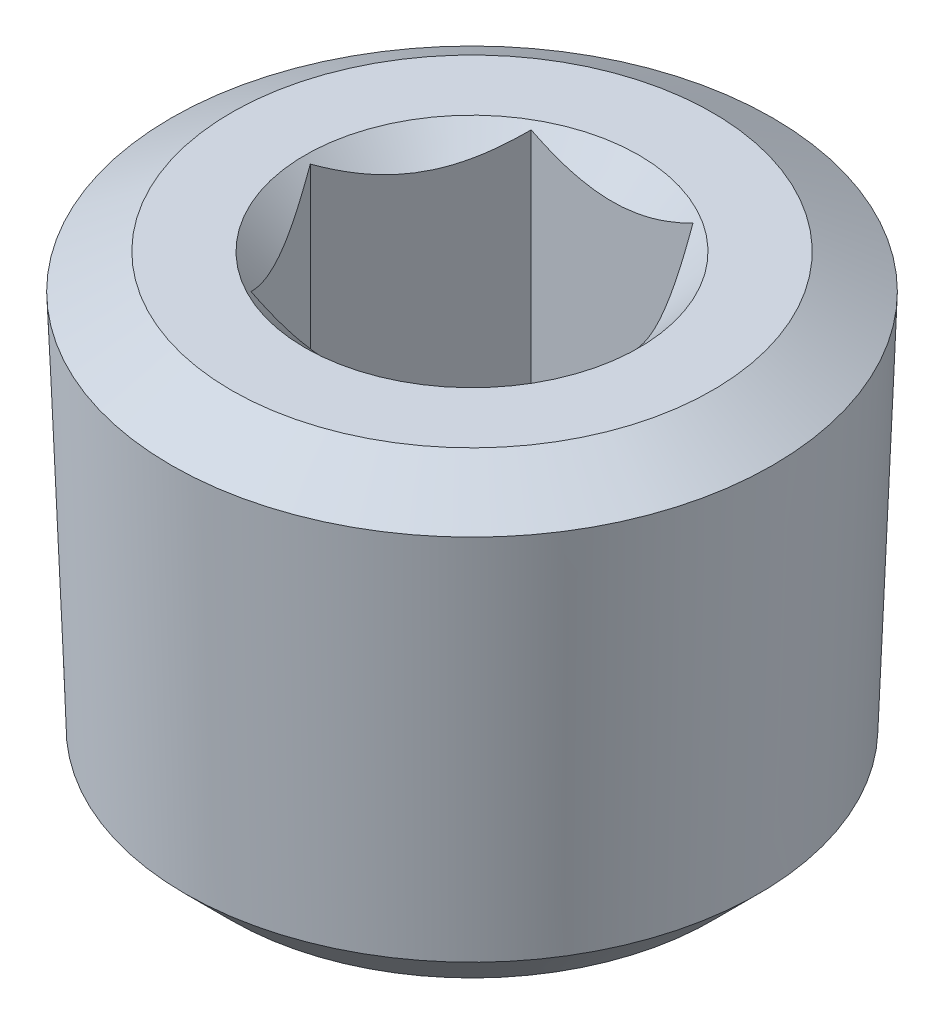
ISO-10303-21;
HEADER;
FILE_DESCRIPTION(('STEP AP214'),'2;1');
FILE_NAME('part.step','',(''),(''),'','','');
FILE_SCHEMA(('AUTOMOTIVE_DESIGN { 1 0 10303 214 1 1 1 1 }'));
ENDSEC;
DATA;
#1=APPLICATION_CONTEXT('core data for automotive mechanical design processes');
#2=APPLICATION_PROTOCOL_DEFINITION('international standard','automotive_design',2000,#1);
#3=PRODUCT_CONTEXT('',#1,'mechanical');
#4=PRODUCT('Part','Part','',(#3));
#5=PRODUCT_RELATED_PRODUCT_CATEGORY('part','',(#4));
#6=PRODUCT_DEFINITION_FORMATION('','',#4);
#7=PRODUCT_DEFINITION_CONTEXT('part definition',#1,'design');
#8=PRODUCT_DEFINITION('design','',#6,#7);
#9=PRODUCT_DEFINITION_SHAPE('','',#8);
#10=(LENGTH_UNIT() NAMED_UNIT(*) SI_UNIT(.MILLI.,.METRE.));
#11=(NAMED_UNIT(*) PLANE_ANGLE_UNIT() SI_UNIT($,.RADIAN.));
#12=(NAMED_UNIT(*) SI_UNIT($,.STERADIAN.) SOLID_ANGLE_UNIT());
#13=UNCERTAINTY_MEASURE_WITH_UNIT(LENGTH_MEASURE(1.E-05),#10,'distance_accuracy_value','');
#14=(GEOMETRIC_REPRESENTATION_CONTEXT(3) GLOBAL_UNCERTAINTY_ASSIGNED_CONTEXT((#13)) GLOBAL_UNIT_ASSIGNED_CONTEXT((#10,
#11,#12)) REPRESENTATION_CONTEXT('',''));
#15=CARTESIAN_POINT('',(0.,0.,0.));
#16=DIRECTION('',(0.,0.,1.));
#17=DIRECTION('',(1.,0.,0.));
#18=AXIS2_PLACEMENT_3D('',#15,#16,#17);
#19=CARTESIAN_POINT('',(0.,0.,0.));
#20=DIRECTION('',(0.,1.,0.));
#21=DIRECTION('',(0.,0.,1.));
#22=AXIS2_PLACEMENT_3D('',#19,#20,#21);
#23=PLANE('',#22);
#24=CARTESIAN_POINT('',(0.,0.,0.));
#25=DIRECTION('',(0.,1.,0.));
#26=DIRECTION('',(0.,0.,1.));
#27=AXIS2_PLACEMENT_3D('',#24,#25,#26);
#28=CIRCLE('',#27,4.7371);
#29=CARTESIAN_POINT('',(0.,0.,4.7371));
#30=VERTEX_POINT('',#29);
#31=EDGE_CURVE('E245',#30,#30,#28,.T.);
#32=ORIENTED_EDGE('',*,*,#31,.F.);
#33=EDGE_LOOP('',(#32));
#34=FACE_BOUND('',#33,.T.);
#35=CARTESIAN_POINT('',(0.,0.,0.));
#36=DIRECTION('',(0.,1.,0.));
#37=DIRECTION('',(0.,0.,1.));
#38=AXIS2_PLACEMENT_3D('',#35,#36,#37);
#39=CIRCLE('',#38,6.82743694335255);
#40=CARTESIAN_POINT('',(0.,0.,6.82743694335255));
#41=VERTEX_POINT('',#40);
#42=EDGE_CURVE('E12',#41,#41,#39,.T.);
#43=ORIENTED_EDGE('',*,*,#42,.T.);
#44=EDGE_LOOP('',(#43));
#45=FACE_BOUND('',#44,.T.);
#46=ADVANCED_FACE('F34',(#34,#45),#23,.T.);
#47=CARTESIAN_POINT('',(0.,0.,0.));
#48=DIRECTION('',(0.,-1.,0.));
#49=DIRECTION('',(0.,0.,-1.));
#50=AXIS2_PLACEMENT_3D('',#47,#48,#49);
#51=CONICAL_SURFACE('',#50,6.82743694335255,1.0471975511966);
#52=CARTESIAN_POINT('',(0.,-0.986742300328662,0.));
#53=DIRECTION('',(0.,1.,0.));
#54=DIRECTION('',(0.,0.,1.));
#55=AXIS2_PLACEMENT_3D('',#52,#53,#54);
#56=CIRCLE('',#55,8.53652474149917);
#57=CARTESIAN_POINT('',(0.,-0.986742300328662,8.53652474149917));
#58=VERTEX_POINT('',#57);
#59=EDGE_CURVE('E41',#58,#58,#56,.T.);
#60=ORIENTED_EDGE('',*,*,#59,.T.);
#61=EDGE_LOOP('',(#60));
#62=FACE_BOUND('',#61,.T.);
#63=ORIENTED_EDGE('',*,*,#42,.F.);
#64=EDGE_LOOP('',(#63));
#65=FACE_BOUND('',#64,.T.);
#66=ADVANCED_FACE('F235',(#62,#65),#51,.T.);
#67=CARTESIAN_POINT('',(0.,-0.986742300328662,0.));
#68=DIRECTION('',(0.,1.,0.));
#69=DIRECTION('',(0.,0.,1.));
#70=AXIS2_PLACEMENT_3D('',#67,#68,#69);
#71=CONICAL_SURFACE('',#70,8.53652474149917,0.0364424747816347);
#72=CARTESIAN_POINT('',(0.,-11.712145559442,0.));
#73=DIRECTION('',(0.,1.,0.));
#74=DIRECTION('',(0.,0.,1.));
#75=AXIS2_PLACEMENT_3D('',#72,#73,#74);
#76=CIRCLE('',#75,8.14549138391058);
#77=CARTESIAN_POINT('',(0.,-11.712145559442,8.14549138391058));
#78=VERTEX_POINT('',#77);
#79=EDGE_CURVE('E253',#78,#78,#76,.T.);
#80=ORIENTED_EDGE('',*,*,#79,.T.);
#81=EDGE_LOOP('',(#80));
#82=FACE_BOUND('',#81,.T.);
#83=ORIENTED_EDGE('',*,*,#59,.F.);
#84=EDGE_LOOP('',(#83));
#85=FACE_BOUND('',#84,.T.);
#86=ADVANCED_FACE('F240',(#82,#85),#71,.T.);
#87=CARTESIAN_POINT('',(0.,-11.712145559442,0.));
#88=DIRECTION('',(0.,1.,0.));
#89=DIRECTION('',(0.,0.,1.));
#90=AXIS2_PLACEMENT_3D('',#87,#88,#89);
#91=CONICAL_SURFACE('',#90,8.14549138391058,0.785398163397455);
#92=CARTESIAN_POINT('',(0.,-13.0302,0.));
#93=DIRECTION('',(0.,1.,0.));
#94=DIRECTION('',(0.,0.,1.));
#95=AXIS2_PLACEMENT_3D('',#92,#93,#94);
#96=CIRCLE('',#95,6.82743694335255);
#97=CARTESIAN_POINT('',(0.,-13.0302,6.82743694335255));
#98=VERTEX_POINT('',#97);
#99=EDGE_CURVE('E249',#98,#98,#96,.T.);
#100=ORIENTED_EDGE('',*,*,#99,.T.);
#101=EDGE_LOOP('',(#100));
#102=FACE_BOUND('',#101,.T.);
#103=ORIENTED_EDGE('',*,*,#79,.F.);
#104=EDGE_LOOP('',(#103));
#105=FACE_BOUND('',#104,.T.);
#106=ADVANCED_FACE('F264',(#102,#105),#91,.T.);
#107=CARTESIAN_POINT('',(-6.82743694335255,-13.0302,0.));
#108=DIRECTION('',(0.,-1.,0.));
#109=DIRECTION('',(0.,0.,-1.));
#110=AXIS2_PLACEMENT_3D('',#107,#108,#109);
#111=PLANE('',#110);
#112=ORIENTED_EDGE('',*,*,#99,.F.);
#113=EDGE_LOOP('',(#112));
#114=FACE_BOUND('',#113,.T.);
#115=ADVANCED_FACE('F178',(#114),#111,.T.);
#116=CARTESIAN_POINT('',(0.,0.,0.));
#117=DIRECTION('',(0.,1.,0.));
#118=DIRECTION('',(0.,0.,1.));
#119=AXIS2_PLACEMENT_3D('',#116,#117,#118);
#120=CONICAL_SURFACE('',#119,4.7371,0.785398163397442);
#121=CARTESIAN_POINT('',(-4.84909764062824,1.53308085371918,3.9751));
#122=CARTESIAN_POINT('',(-4.73217167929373,1.44267539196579,3.9751));
#123=CARTESIAN_POINT('',(-4.61462251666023,1.35306340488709,3.9751));
#124=CARTESIAN_POINT('',(-4.37802066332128,1.17579084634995,3.9751));
#125=CARTESIAN_POINT('',(-4.25896762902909,1.08813073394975,3.9751));
#126=CARTESIAN_POINT('',(-4.01823171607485,0.914502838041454,3.9751));
#127=CARTESIAN_POINT('',(-3.89653564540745,0.828553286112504,3.9751));
#128=CARTESIAN_POINT('',(-3.65113000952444,0.659588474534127,3.9751));
#129=CARTESIAN_POINT('',(-3.52742058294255,0.576573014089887,3.9751));
#130=CARTESIAN_POINT('',(-3.26950382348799,0.408855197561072,3.9751));
#131=CARTESIAN_POINT('',(-3.13513782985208,0.324395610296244,3.9751));
#132=CARTESIAN_POINT('',(-2.86324687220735,0.160636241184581,3.9751));
#133=CARTESIAN_POINT('',(-2.72572137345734,0.0813373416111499,3.9751));
#134=CARTESIAN_POINT('',(-2.44745996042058,-0.0704182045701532,3.9751));
#135=CARTESIAN_POINT('',(-2.30673507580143,-0.142894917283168,3.9751));
#136=CARTESIAN_POINT('',(-2.02127023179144,-0.279382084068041,3.9751));
#137=CARTESIAN_POINT('',(-1.87653222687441,-0.343396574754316,3.9751));
#138=CARTESIAN_POINT('',(-1.5978890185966,-0.454566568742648,3.9751));
#139=CARTESIAN_POINT('',(-1.46441051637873,-0.502780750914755,3.9751));
#140=CARTESIAN_POINT('',(-1.19400195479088,-0.588529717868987,3.9751));
#141=CARTESIAN_POINT('',(-1.05707168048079,-0.626063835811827,3.9751));
#142=CARTESIAN_POINT('',(-0.782993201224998,-0.687773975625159,3.9751));
#143=CARTESIAN_POINT('',(-0.645901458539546,-0.712196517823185,3.9751));
#144=CARTESIAN_POINT('',(-0.36994953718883,-0.747165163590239,3.9751));
#145=CARTESIAN_POINT('',(-0.231089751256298,-0.757714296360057,3.9751));
#146=CARTESIAN_POINT('',(0.0405804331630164,-0.764005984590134,3.9751));
#147=CARTESIAN_POINT('',(0.173375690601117,-0.760406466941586,3.9751));
#148=CARTESIAN_POINT('',(0.437956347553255,-0.740123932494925,3.9751));
#149=CARTESIAN_POINT('',(0.569741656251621,-0.723439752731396,3.9751));
#150=CARTESIAN_POINT('',(0.833584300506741,-0.677656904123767,3.9751));
#151=CARTESIAN_POINT('',(0.965602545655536,-0.648336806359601,3.9751));
#152=CARTESIAN_POINT('',(1.22672185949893,-0.578926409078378,3.9751));
#153=CARTESIAN_POINT('',(1.35582307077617,-0.538836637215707,3.9751));
#154=CARTESIAN_POINT('',(1.61707549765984,-0.447503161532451,3.9751));
#155=CARTESIAN_POINT('',(1.74906788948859,-0.395810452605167,3.9751));
#156=CARTESIAN_POINT('',(2.0096644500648,-0.284428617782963,3.9751));
#157=CARTESIAN_POINT('',(2.13826707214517,-0.224735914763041,3.9751));
#158=CARTESIAN_POINT('',(2.39268673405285,-0.0987689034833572,3.9751));
#159=CARTESIAN_POINT('',(2.51849370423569,-0.0324744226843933,3.9751));
#160=CARTESIAN_POINT('',(2.76722744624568,0.105238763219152,3.9751));
#161=CARTESIAN_POINT('',(2.89015465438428,0.176656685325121,3.9751));
#162=CARTESIAN_POINT('',(3.12750338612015,0.31999408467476,3.9751));
#163=CARTESIAN_POINT('',(3.24204539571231,0.391715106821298,3.9751));
#164=CARTESIAN_POINT('',(3.4691612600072,0.538217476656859,3.9751));
#165=CARTESIAN_POINT('',(3.58173496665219,0.612999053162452,3.9751));
#166=CARTESIAN_POINT('',(3.80426855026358,0.764470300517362,3.9751));
#167=CARTESIAN_POINT('',(3.91424213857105,0.841139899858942,3.9751));
#168=CARTESIAN_POINT('',(4.13267949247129,0.996540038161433,3.9751));
#169=CARTESIAN_POINT('',(4.24114366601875,1.07527000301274,3.9751));
#170=CARTESIAN_POINT('',(4.34897443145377,1.15484353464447,3.9751));
#171=B_SPLINE_CURVE_WITH_KNOTS('',3,(#121,#122,#123,#124,#125,#126,#127,#128,#129,#130,#131,
#132,#133,#134,#135,#136,#137,#138,#139,#140,#141,#142,#143,#144,#145,#146,#147,#148,#149,#150,
#151,#152,#153,#154,#155,#156,#157,#158,#159,#160,#161,#162,#163,#164,#165,#166,#167,#168,#169,
#170),.UNSPECIFIED.,.F.,.F.,(4,2,2,2,2,2,2,2,2,2,2,2,2,2,2,2,2,2,2,2,2,2,2,2,4),(0.,
0.443407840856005,0.886918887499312,1.33384544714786,1.78074136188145,2.25676766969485,
2.73287514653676,3.20753536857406,3.6819683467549,4.10736140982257,4.53278102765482,
4.94989388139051,5.36691564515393,5.76478013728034,6.16267999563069,6.56785572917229,
6.97301161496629,7.39794831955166,7.82307566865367,8.24954441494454,8.67594812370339,
9.08132177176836,9.48672578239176,9.8888838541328,10.2909310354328),.UNSPECIFIED.);
#172=CARTESIAN_POINT('',(2.29502505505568,-0.14704988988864,3.9751));
#173=VERTEX_POINT('',#172);
#174=CARTESIAN_POINT('',(-2.29502505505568,-0.14704988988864,3.9751));
#175=VERTEX_POINT('',#174);
#176=EDGE_CURVE('E48',#173,#175,#171,.F.);
#177=ORIENTED_EDGE('',*,*,#176,.T.);
#178=CARTESIAN_POINT('',(-2.29490958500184,-0.146934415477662,3.9753));
#179=CARTESIAN_POINT('',(-2.33437312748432,-0.186393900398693,3.90694713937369));
#180=CARTESIAN_POINT('',(-2.37413865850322,-0.224642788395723,3.838071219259));
#181=CARTESIAN_POINT('',(-2.45433590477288,-0.298350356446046,3.69916551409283));
#182=CARTESIAN_POINT('',(-2.49476796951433,-0.333807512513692,3.62913512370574));
#183=CARTESIAN_POINT('',(-2.6175329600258,-0.435740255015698,3.41649992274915));
#184=CARTESIAN_POINT('',(-2.70090926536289,-0.49734220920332,3.27208792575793));
#185=CARTESIAN_POINT('',(-2.86901166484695,-0.602838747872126,2.98092602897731));
#186=CARTESIAN_POINT('',(-2.95369529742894,-0.646998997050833,2.83424967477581));
#187=CARTESIAN_POINT('',(-3.12493250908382,-0.715042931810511,2.53765812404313));
#188=CARTESIAN_POINT('',(-3.21148084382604,-0.738977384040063,2.38775201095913));
#189=CARTESIAN_POINT('',(-3.36064344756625,-0.760571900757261,2.12939480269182));
#190=CARTESIAN_POINT('',(-3.42306553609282,-0.763767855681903,2.02127657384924));
#191=CARTESIAN_POINT('',(-3.54780839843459,-0.758380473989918,1.80521559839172));
#192=CARTESIAN_POINT('',(-3.61012912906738,-0.749793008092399,1.69727292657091));
#193=CARTESIAN_POINT('',(-3.73418008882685,-0.721328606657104,1.48241036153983));
#194=CARTESIAN_POINT('',(-3.79590957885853,-0.701439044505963,1.37549174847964));
#195=CARTESIAN_POINT('',(-3.9183083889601,-0.651456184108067,1.16349079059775));
#196=CARTESIAN_POINT('',(-3.97897778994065,-0.621363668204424,1.05840830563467));
#197=CARTESIAN_POINT('',(-4.08668064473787,-0.559451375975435,0.871861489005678));
#198=CARTESIAN_POINT('',(-4.13395255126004,-0.529259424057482,0.789984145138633));
#199=CARTESIAN_POINT('',(-4.22764774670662,-0.464009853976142,0.627699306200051));
#200=CARTESIAN_POINT('',(-4.27407100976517,-0.428952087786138,0.547291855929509));
#201=CARTESIAN_POINT('',(-4.36592265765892,-0.354756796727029,0.388200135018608));
#202=CARTESIAN_POINT('',(-4.41135365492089,-0.315632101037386,0.309511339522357));
#203=CARTESIAN_POINT('',(-4.50137431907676,-0.233816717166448,0.153590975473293));
#204=CARTESIAN_POINT('',(-4.54596448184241,-0.191128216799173,0.0763585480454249));
#205=CARTESIAN_POINT('',(-4.5901655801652,-0.14693441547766,-0.000199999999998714));
#206=B_SPLINE_CURVE_WITH_KNOTS('',3,(#178,#179,#180,#181,#182,#183,#184,#185,#186,#187,#188,
#189,#190,#191,#192,#193,#194,#195,#196,#197,#198,#199,#200,#201,#202,#203,#204,#205),
.UNSPECIFIED.,.F.,.F.,(4,2,2,2,2,2,2,2,2,2,2,2,2,4),(0.,0.264704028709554,0.529551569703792,
1.06210632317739,1.58620390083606,2.10898205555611,2.48310879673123,2.85736667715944,
3.23204349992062,3.60669159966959,3.90429483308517,4.20190712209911,4.49860754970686,
4.79512715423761),.UNSPECIFIED.);
#207=CARTESIAN_POINT('',(-4.59005011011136,-0.147049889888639,0.));
#208=VERTEX_POINT('',#207);
#209=EDGE_CURVE('E120',#175,#208,#206,.T.);
#210=ORIENTED_EDGE('',*,*,#209,.T.);
#211=CARTESIAN_POINT('',(-4.5901655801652,-0.14693441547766,0.000200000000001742));
#212=CARTESIAN_POINT('',(-4.55070203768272,-0.186393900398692,-0.0681528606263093));
#213=CARTESIAN_POINT('',(-4.51093650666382,-0.224642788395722,-0.137028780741));
#214=CARTESIAN_POINT('',(-4.43073926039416,-0.298350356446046,-0.275934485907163));
#215=CARTESIAN_POINT('',(-4.39030719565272,-0.333807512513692,-0.345964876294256));
#216=CARTESIAN_POINT('',(-4.26754220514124,-0.435740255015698,-0.558600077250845));
#217=CARTESIAN_POINT('',(-4.18416589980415,-0.497342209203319,-0.703012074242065));
#218=CARTESIAN_POINT('',(-4.01606350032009,-0.602838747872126,-0.994173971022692));
#219=CARTESIAN_POINT('',(-3.9313798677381,-0.646998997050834,-1.14085032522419));
#220=CARTESIAN_POINT('',(-3.76014265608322,-0.715042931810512,-1.43744187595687));
#221=CARTESIAN_POINT('',(-3.673594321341,-0.738977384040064,-1.58734798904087));
#222=CARTESIAN_POINT('',(-3.52443171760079,-0.760571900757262,-1.84570519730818));
#223=CARTESIAN_POINT('',(-3.46200962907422,-0.763767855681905,-1.95382342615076));
#224=CARTESIAN_POINT('',(-3.33726676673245,-0.758380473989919,-2.16988440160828));
#225=CARTESIAN_POINT('',(-3.27494603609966,-0.7497930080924,-2.27782707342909));
#226=CARTESIAN_POINT('',(-3.15089507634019,-0.721328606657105,-2.49268963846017));
#227=CARTESIAN_POINT('',(-3.08916558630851,-0.701439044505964,-2.59960825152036));
#228=CARTESIAN_POINT('',(-2.96676677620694,-0.651456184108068,-2.81160920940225));
#229=CARTESIAN_POINT('',(-2.90609737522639,-0.621363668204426,-2.91669169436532));
#230=CARTESIAN_POINT('',(-2.79839452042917,-0.559451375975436,-3.10323851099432));
#231=CARTESIAN_POINT('',(-2.75112261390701,-0.529259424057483,-3.18511585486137));
#232=CARTESIAN_POINT('',(-2.65742741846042,-0.464009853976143,-3.34740069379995));
#233=CARTESIAN_POINT('',(-2.61100415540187,-0.428952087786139,-3.42780814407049));
#234=CARTESIAN_POINT('',(-2.51915250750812,-0.35475679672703,-3.58689986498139));
#235=CARTESIAN_POINT('',(-2.47372151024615,-0.315632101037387,-3.66558866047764));
#236=CARTESIAN_POINT('',(-2.38370084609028,-0.23381671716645,-3.82150902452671));
#237=CARTESIAN_POINT('',(-2.33911068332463,-0.191128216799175,-3.89874145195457));
#238=CARTESIAN_POINT('',(-2.29490958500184,-0.146934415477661,-3.9753));
#239=B_SPLINE_CURVE_WITH_KNOTS('',3,(#211,#212,#213,#214,#215,#216,#217,#218,#219,#220,#221,
#222,#223,#224,#225,#226,#227,#228,#229,#230,#231,#232,#233,#234,#235,#236,#237,#238),
.UNSPECIFIED.,.F.,.F.,(4,2,2,2,2,2,2,2,2,2,2,2,2,4),(0.,0.264704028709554,0.529551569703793,
1.0621063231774,1.58620390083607,2.10898205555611,2.48310879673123,2.85736667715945,
3.23204349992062,3.60669159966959,3.90429483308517,4.20190712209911,4.49860754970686,
4.79512715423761),.UNSPECIFIED.);
#240=CARTESIAN_POINT('',(-2.29502505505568,-0.147049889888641,-3.9751));
#241=VERTEX_POINT('',#240);
#242=EDGE_CURVE('E202',#208,#241,#239,.T.);
#243=ORIENTED_EDGE('',*,*,#242,.T.);
#244=CARTESIAN_POINT('',(-4.84909764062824,1.53308085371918,-3.9751));
#245=CARTESIAN_POINT('',(-4.73217167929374,1.44267539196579,-3.9751));
#246=CARTESIAN_POINT('',(-4.61462251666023,1.3530634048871,-3.9751));
#247=CARTESIAN_POINT('',(-4.37802066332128,1.17579084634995,-3.9751));
#248=CARTESIAN_POINT('',(-4.25896762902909,1.08813073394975,-3.9751));
#249=CARTESIAN_POINT('',(-4.01823171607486,0.914502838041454,-3.9751));
#250=CARTESIAN_POINT('',(-3.89653564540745,0.828553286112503,-3.9751));
#251=CARTESIAN_POINT('',(-3.65113000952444,0.659588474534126,-3.9751));
#252=CARTESIAN_POINT('',(-3.52742058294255,0.576573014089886,-3.9751));
#253=CARTESIAN_POINT('',(-3.26950382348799,0.408855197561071,-3.9751));
#254=CARTESIAN_POINT('',(-3.13513782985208,0.324395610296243,-3.9751));
#255=CARTESIAN_POINT('',(-2.86324687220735,0.16063624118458,-3.9751));
#256=CARTESIAN_POINT('',(-2.72572137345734,0.0813373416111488,-3.9751));
#257=CARTESIAN_POINT('',(-2.44745996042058,-0.0704182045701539,-3.9751));
#258=CARTESIAN_POINT('',(-2.30673507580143,-0.142894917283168,-3.9751));
#259=CARTESIAN_POINT('',(-2.02127023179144,-0.279382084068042,-3.9751));
#260=CARTESIAN_POINT('',(-1.87653222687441,-0.343396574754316,-3.9751));
#261=CARTESIAN_POINT('',(-1.5978890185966,-0.454566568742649,-3.9751));
#262=CARTESIAN_POINT('',(-1.46441051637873,-0.502780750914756,-3.9751));
#263=CARTESIAN_POINT('',(-1.19400195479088,-0.588529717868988,-3.9751));
#264=CARTESIAN_POINT('',(-1.05707168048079,-0.626063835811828,-3.9751));
#265=CARTESIAN_POINT('',(-0.782993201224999,-0.687773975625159,-3.9751));
#266=CARTESIAN_POINT('',(-0.645901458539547,-0.712196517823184,-3.9751));
#267=CARTESIAN_POINT('',(-0.369949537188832,-0.747165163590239,-3.9751));
#268=CARTESIAN_POINT('',(-0.231089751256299,-0.757714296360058,-3.9751));
#269=CARTESIAN_POINT('',(0.040580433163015,-0.764005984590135,-3.9751));
#270=CARTESIAN_POINT('',(0.173375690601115,-0.760406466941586,-3.9751));
#271=CARTESIAN_POINT('',(0.437956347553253,-0.740123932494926,-3.9751));
#272=CARTESIAN_POINT('',(0.569741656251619,-0.723439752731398,-3.9751));
#273=CARTESIAN_POINT('',(0.83358430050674,-0.677656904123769,-3.9751));
#274=CARTESIAN_POINT('',(0.965602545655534,-0.648336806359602,-3.9751));
#275=CARTESIAN_POINT('',(1.22672185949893,-0.578926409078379,-3.9751));
#276=CARTESIAN_POINT('',(1.35582307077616,-0.538836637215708,-3.9751));
#277=CARTESIAN_POINT('',(1.61707549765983,-0.447503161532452,-3.9751));
#278=CARTESIAN_POINT('',(1.74906788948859,-0.395810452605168,-3.9751));
#279=CARTESIAN_POINT('',(2.0096644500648,-0.284428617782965,-3.9751));
#280=CARTESIAN_POINT('',(2.13826707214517,-0.224735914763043,-3.9751));
#281=CARTESIAN_POINT('',(2.39268673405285,-0.0987689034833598,-3.9751));
#282=CARTESIAN_POINT('',(2.51849370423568,-0.0324744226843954,-3.9751));
#283=CARTESIAN_POINT('',(2.76722744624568,0.10523876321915,-3.9751));
#284=CARTESIAN_POINT('',(2.89015465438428,0.176656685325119,-3.9751));
#285=CARTESIAN_POINT('',(3.12750338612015,0.319994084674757,-3.9751));
#286=CARTESIAN_POINT('',(3.24204539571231,0.391715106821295,-3.9751));
#287=CARTESIAN_POINT('',(3.4691612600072,0.538217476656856,-3.9751));
#288=CARTESIAN_POINT('',(3.58173496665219,0.612999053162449,-3.9751));
#289=CARTESIAN_POINT('',(3.80426855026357,0.764470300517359,-3.9751));
#290=CARTESIAN_POINT('',(3.91424213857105,0.841139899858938,-3.9751));
#291=CARTESIAN_POINT('',(4.13267949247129,0.996540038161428,-3.9751));
#292=CARTESIAN_POINT('',(4.24114366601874,1.07527000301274,-3.9751));
#293=CARTESIAN_POINT('',(4.34897443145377,1.15484353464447,-3.9751));
#294=B_SPLINE_CURVE_WITH_KNOTS('',3,(#244,#245,#246,#247,#248,#249,#250,#251,#252,#253,#254,
#255,#256,#257,#258,#259,#260,#261,#262,#263,#264,#265,#266,#267,#268,#269,#270,#271,#272,#273,
#274,#275,#276,#277,#278,#279,#280,#281,#282,#283,#284,#285,#286,#287,#288,#289,#290,#291,#292,
#293),.UNSPECIFIED.,.F.,.F.,(4,2,2,2,2,2,2,2,2,2,2,2,2,2,2,2,2,2,2,2,2,2,2,2,4),(0.,
0.443407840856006,0.886918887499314,1.33384544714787,1.78074136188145,2.25676766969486,
2.73287514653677,3.20753536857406,3.6819683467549,4.10736140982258,4.53278102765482,
4.94989388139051,5.36691564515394,5.76478013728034,6.16267999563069,6.56785572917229,
6.97301161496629,7.39794831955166,7.82307566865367,8.24954441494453,8.67594812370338,
9.08132177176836,9.48672578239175,9.8888838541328,10.2909310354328),.UNSPECIFIED.);
#295=CARTESIAN_POINT('',(2.29502505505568,-0.147049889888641,-3.9751));
#296=VERTEX_POINT('',#295);
#297=EDGE_CURVE('E195',#241,#296,#294,.T.);
#298=ORIENTED_EDGE('',*,*,#297,.T.);
#299=CARTESIAN_POINT('',(2.29490958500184,-0.146934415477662,-3.9753));
#300=CARTESIAN_POINT('',(2.33437312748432,-0.186393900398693,-3.90694713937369));
#301=CARTESIAN_POINT('',(2.37413865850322,-0.224642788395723,-3.838071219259));
#302=CARTESIAN_POINT('',(2.45433590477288,-0.298350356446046,-3.69916551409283));
#303=CARTESIAN_POINT('',(2.49476796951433,-0.333807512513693,-3.62913512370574));
#304=CARTESIAN_POINT('',(2.6175329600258,-0.435740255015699,-3.41649992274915));
#305=CARTESIAN_POINT('',(2.7009092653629,-0.49734220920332,-3.27208792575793));
#306=CARTESIAN_POINT('',(2.86901166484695,-0.602838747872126,-2.9809260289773));
#307=CARTESIAN_POINT('',(2.95369529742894,-0.646998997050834,-2.83424967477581));
#308=CARTESIAN_POINT('',(3.12493250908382,-0.715042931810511,-2.53765812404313));
#309=CARTESIAN_POINT('',(3.21148084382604,-0.738977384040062,-2.38775201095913));
#310=CARTESIAN_POINT('',(3.36064344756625,-0.760571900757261,-2.12939480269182));
#311=CARTESIAN_POINT('',(3.42306553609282,-0.763767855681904,-2.02127657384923));
#312=CARTESIAN_POINT('',(3.54780839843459,-0.758380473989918,-1.80521559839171));
#313=CARTESIAN_POINT('',(3.61012912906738,-0.749793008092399,-1.69727292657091));
#314=CARTESIAN_POINT('',(3.73418008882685,-0.721328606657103,-1.48241036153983));
#315=CARTESIAN_POINT('',(3.79590957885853,-0.701439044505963,-1.37549174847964));
#316=CARTESIAN_POINT('',(3.9183083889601,-0.651456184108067,-1.16349079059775));
#317=CARTESIAN_POINT('',(3.97897778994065,-0.621363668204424,-1.05840830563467));
#318=CARTESIAN_POINT('',(4.08668064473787,-0.559451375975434,-0.871861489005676));
#319=CARTESIAN_POINT('',(4.13395255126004,-0.529259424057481,-0.789984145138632));
#320=CARTESIAN_POINT('',(4.22764774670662,-0.464009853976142,-0.62769930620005));
#321=CARTESIAN_POINT('',(4.27407100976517,-0.428952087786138,-0.547291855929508));
#322=CARTESIAN_POINT('',(4.36592265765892,-0.354756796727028,-0.388200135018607));
#323=CARTESIAN_POINT('',(4.41135365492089,-0.315632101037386,-0.309511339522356));
#324=CARTESIAN_POINT('',(4.50137431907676,-0.233816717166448,-0.153590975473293));
#325=CARTESIAN_POINT('',(4.54596448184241,-0.191128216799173,-0.076358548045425));
#326=CARTESIAN_POINT('',(4.5901655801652,-0.14693441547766,0.000199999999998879));
#327=B_SPLINE_CURVE_WITH_KNOTS('',3,(#299,#300,#301,#302,#303,#304,#305,#306,#307,#308,#309,
#310,#311,#312,#313,#314,#315,#316,#317,#318,#319,#320,#321,#322,#323,#324,#325,#326),
.UNSPECIFIED.,.F.,.F.,(4,2,2,2,2,2,2,2,2,2,2,2,2,4),(0.,0.264704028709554,0.529551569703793,
1.0621063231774,1.58620390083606,2.10898205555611,2.48310879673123,2.85736667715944,
3.23204349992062,3.60669159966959,3.90429483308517,4.20190712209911,4.49860754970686,
4.79512715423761),.UNSPECIFIED.);
#328=CARTESIAN_POINT('',(4.59005011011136,-0.147049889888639,0.));
#329=VERTEX_POINT('',#328);
#330=EDGE_CURVE('E188',#296,#329,#327,.T.);
#331=ORIENTED_EDGE('',*,*,#330,.T.);
#332=CARTESIAN_POINT('',(4.5901655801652,-0.14693441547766,-0.000200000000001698));
#333=CARTESIAN_POINT('',(4.55070203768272,-0.186393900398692,0.0681528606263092));
#334=CARTESIAN_POINT('',(4.51093650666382,-0.224642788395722,0.137028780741));
#335=CARTESIAN_POINT('',(4.43073926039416,-0.298350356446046,0.275934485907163));
#336=CARTESIAN_POINT('',(4.39030719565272,-0.333807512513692,0.345964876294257));
#337=CARTESIAN_POINT('',(4.26754220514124,-0.435740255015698,0.558600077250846));
#338=CARTESIAN_POINT('',(4.18416589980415,-0.49734220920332,0.703012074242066));
#339=CARTESIAN_POINT('',(4.01606350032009,-0.602838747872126,0.994173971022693));
#340=CARTESIAN_POINT('',(3.9313798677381,-0.646998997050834,1.14085032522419));
#341=CARTESIAN_POINT('',(3.76014265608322,-0.715042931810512,1.43744187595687));
#342=CARTESIAN_POINT('',(3.673594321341,-0.738977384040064,1.58734798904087));
#343=CARTESIAN_POINT('',(3.52443171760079,-0.760571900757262,1.84570519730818));
#344=CARTESIAN_POINT('',(3.46200962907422,-0.763767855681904,1.95382342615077));
#345=CARTESIAN_POINT('',(3.33726676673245,-0.758380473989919,2.16988440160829));
#346=CARTESIAN_POINT('',(3.27494603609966,-0.749793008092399,2.27782707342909));
#347=CARTESIAN_POINT('',(3.15089507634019,-0.721328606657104,2.49268963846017));
#348=CARTESIAN_POINT('',(3.08916558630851,-0.701439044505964,2.59960825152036));
#349=CARTESIAN_POINT('',(2.96676677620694,-0.651456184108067,2.81160920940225));
#350=CARTESIAN_POINT('',(2.90609737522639,-0.621363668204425,2.91669169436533));
#351=CARTESIAN_POINT('',(2.79839452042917,-0.559451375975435,3.10323851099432));
#352=CARTESIAN_POINT('',(2.751122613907,-0.529259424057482,3.18511585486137));
#353=CARTESIAN_POINT('',(2.65742741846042,-0.464009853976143,3.34740069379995));
#354=CARTESIAN_POINT('',(2.61100415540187,-0.428952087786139,3.42780814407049));
#355=CARTESIAN_POINT('',(2.51915250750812,-0.35475679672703,3.58689986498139));
#356=CARTESIAN_POINT('',(2.47372151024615,-0.315632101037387,3.66558866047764));
#357=CARTESIAN_POINT('',(2.38370084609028,-0.23381671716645,3.82150902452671));
#358=CARTESIAN_POINT('',(2.33911068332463,-0.191128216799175,3.89874145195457));
#359=CARTESIAN_POINT('',(2.29490958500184,-0.146934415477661,3.9753));
#360=B_SPLINE_CURVE_WITH_KNOTS('',3,(#332,#333,#334,#335,#336,#337,#338,#339,#340,#341,#342,
#343,#344,#345,#346,#347,#348,#349,#350,#351,#352,#353,#354,#355,#356,#357,#358,#359),
.UNSPECIFIED.,.F.,.F.,(4,2,2,2,2,2,2,2,2,2,2,2,2,4),(0.,0.264704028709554,0.529551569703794,
1.0621063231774,1.58620390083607,2.10898205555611,2.48310879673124,2.85736667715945,
3.23204349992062,3.60669159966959,3.90429483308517,4.20190712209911,4.49860754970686,
4.79512715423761),.UNSPECIFIED.);
#361=EDGE_CURVE('E164',#329,#173,#360,.T.);
#362=ORIENTED_EDGE('',*,*,#361,.T.);
#363=EDGE_LOOP('',(#177,#210,#243,#298,#331,#362));
#364=FACE_BOUND('',#363,.T.);
#365=ORIENTED_EDGE('',*,*,#31,.T.);
#366=EDGE_LOOP('',(#365));
#367=FACE_BOUND('',#366,.T.);
#368=ADVANCED_FACE('F173',(#364,#367),#120,.F.);
#369=CARTESIAN_POINT('',(-4.59005011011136,-8.128,0.));
#370=DIRECTION('',(-0.866025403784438,0.,0.5));
#371=DIRECTION('',(0.5,0.,0.866025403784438));
#372=AXIS2_PLACEMENT_3D('',#369,#370,#371);
#373=PLANE('',#372);
#374=DIRECTION('',(0.,1.,0.));
#375=VECTOR('',#374,1.);
#376=CARTESIAN_POINT('',(-2.29502505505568,-8.128,3.9751));
#377=LINE('',#376,#375);
#378=CARTESIAN_POINT('',(-2.29502505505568,-8.128,3.9751));
#379=VERTEX_POINT('',#378);
#380=EDGE_CURVE('E117',#379,#175,#377,.T.);
#381=ORIENTED_EDGE('',*,*,#380,.F.);
#382=DIRECTION('',(0.5,0.,0.866025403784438));
#383=VECTOR('',#382,1.);
#384=CARTESIAN_POINT('',(-4.59005011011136,-8.128,0.));
#385=LINE('',#384,#383);
#386=CARTESIAN_POINT('',(-3.44253758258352,-8.128,1.98755));
#387=VERTEX_POINT('',#386);
#388=EDGE_CURVE('E104',#387,#379,#385,.T.);
#389=ORIENTED_EDGE('',*,*,#388,.F.);
#390=CARTESIAN_POINT('',(-4.59005011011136,-8.128,0.));
#391=VERTEX_POINT('',#390);
#392=EDGE_CURVE('E114',#391,#387,#385,.T.);
#393=ORIENTED_EDGE('',*,*,#392,.F.);
#394=DIRECTION('',(0.,1.,0.));
#395=VECTOR('',#394,1.);
#396=CARTESIAN_POINT('',(-4.59005011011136,-8.128,0.));
#397=LINE('',#396,#395);
#398=EDGE_CURVE('E144',#391,#208,#397,.T.);
#399=ORIENTED_EDGE('',*,*,#398,.T.);
#400=ORIENTED_EDGE('',*,*,#209,.F.);
#401=EDGE_LOOP('',(#381,#389,#393,#399,#400));
#402=FACE_BOUND('',#401,.T.);
#403=ADVANCED_FACE('F118',(#402),#373,.F.);
#404=CARTESIAN_POINT('',(-2.29502505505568,-8.128,-3.9751));
#405=DIRECTION('',(-0.866025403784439,0.,-0.5));
#406=DIRECTION('',(-0.5,0.,0.866025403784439));
#407=AXIS2_PLACEMENT_3D('',#404,#405,#406);
#408=PLANE('',#407);
#409=ORIENTED_EDGE('',*,*,#398,.F.);
#410=DIRECTION('',(-0.5,0.,0.866025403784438));
#411=VECTOR('',#410,1.);
#412=CARTESIAN_POINT('',(-2.29502505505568,-8.128,-3.9751));
#413=LINE('',#412,#411);
#414=CARTESIAN_POINT('',(-3.44253758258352,-8.128,-1.98755));
#415=VERTEX_POINT('',#414);
#416=EDGE_CURVE('E141',#415,#391,#413,.T.);
#417=ORIENTED_EDGE('',*,*,#416,.F.);
#418=CARTESIAN_POINT('',(-2.29502505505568,-8.128,-3.9751));
#419=VERTEX_POINT('',#418);
#420=EDGE_CURVE('E123',#419,#415,#413,.T.);
#421=ORIENTED_EDGE('',*,*,#420,.F.);
#422=DIRECTION('',(0.,1.,0.));
#423=VECTOR('',#422,1.);
#424=CARTESIAN_POINT('',(-2.29502505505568,-8.128,-3.9751));
#425=LINE('',#424,#423);
#426=EDGE_CURVE('E146',#419,#241,#425,.T.);
#427=ORIENTED_EDGE('',*,*,#426,.T.);
#428=ORIENTED_EDGE('',*,*,#242,.F.);
#429=EDGE_LOOP('',(#409,#417,#421,#427,#428));
#430=FACE_BOUND('',#429,.T.);
#431=ADVANCED_FACE('F213',(#430),#408,.F.);
#432=CARTESIAN_POINT('',(2.29502505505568,-8.128,-3.9751));
#433=DIRECTION('',(0.,0.,-1.));
#434=DIRECTION('',(-1.,0.,0.));
#435=AXIS2_PLACEMENT_3D('',#432,#433,#434);
#436=PLANE('',#435);
#437=ORIENTED_EDGE('',*,*,#426,.F.);
#438=DIRECTION('',(-1.,0.,0.));
#439=VECTOR('',#438,1.);
#440=CARTESIAN_POINT('',(2.29502505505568,-8.128,-3.9751));
#441=LINE('',#440,#439);
#442=CARTESIAN_POINT('',(0.,-8.128,-3.9751));
#443=VERTEX_POINT('',#442);
#444=EDGE_CURVE('E137',#443,#419,#441,.T.);
#445=ORIENTED_EDGE('',*,*,#444,.F.);
#446=CARTESIAN_POINT('',(2.29502505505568,-8.128,-3.9751));
#447=VERTEX_POINT('',#446);
#448=EDGE_CURVE('E138',#447,#443,#441,.T.);
#449=ORIENTED_EDGE('',*,*,#448,.F.);
#450=DIRECTION('',(0.,1.,0.));
#451=VECTOR('',#450,1.);
#452=CARTESIAN_POINT('',(2.29502505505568,-8.128,-3.9751));
#453=LINE('',#452,#451);
#454=EDGE_CURVE('E149',#447,#296,#453,.T.);
#455=ORIENTED_EDGE('',*,*,#454,.T.);
#456=ORIENTED_EDGE('',*,*,#297,.F.);
#457=EDGE_LOOP('',(#437,#445,#449,#455,#456));
#458=FACE_BOUND('',#457,.T.);
#459=ADVANCED_FACE('F217',(#458),#436,.F.);
#460=CARTESIAN_POINT('',(4.59005011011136,-8.128,0.));
#461=DIRECTION('',(0.866025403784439,0.,-0.5));
#462=DIRECTION('',(-0.5,0.,-0.866025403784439));
#463=AXIS2_PLACEMENT_3D('',#460,#461,#462);
#464=PLANE('',#463);
#465=ORIENTED_EDGE('',*,*,#454,.F.);
#466=DIRECTION('',(-0.5,0.,-0.866025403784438));
#467=VECTOR('',#466,1.);
#468=CARTESIAN_POINT('',(4.59005011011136,-8.128,0.));
#469=LINE('',#468,#467);
#470=CARTESIAN_POINT('',(3.44253758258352,-8.128,-1.98755));
#471=VERTEX_POINT('',#470);
#472=EDGE_CURVE('E133',#471,#447,#469,.T.);
#473=ORIENTED_EDGE('',*,*,#472,.F.);
#474=CARTESIAN_POINT('',(4.59005011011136,-8.128,0.));
#475=VERTEX_POINT('',#474);
#476=EDGE_CURVE('E134',#475,#471,#469,.T.);
#477=ORIENTED_EDGE('',*,*,#476,.F.);
#478=DIRECTION('',(0.,1.,0.));
#479=VECTOR('',#478,1.);
#480=CARTESIAN_POINT('',(4.59005011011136,-8.128,0.));
#481=LINE('',#480,#479);
#482=EDGE_CURVE('E152',#475,#329,#481,.T.);
#483=ORIENTED_EDGE('',*,*,#482,.T.);
#484=ORIENTED_EDGE('',*,*,#330,.F.);
#485=EDGE_LOOP('',(#465,#473,#477,#483,#484));
#486=FACE_BOUND('',#485,.T.);
#487=ADVANCED_FACE('F221',(#486),#464,.F.);
#488=CARTESIAN_POINT('',(2.29502505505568,-8.128,3.9751));
#489=DIRECTION('',(0.866025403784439,0.,0.5));
#490=DIRECTION('',(0.5,0.,-0.866025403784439));
#491=AXIS2_PLACEMENT_3D('',#488,#489,#490);
#492=PLANE('',#491);
#493=ORIENTED_EDGE('',*,*,#482,.F.);
#494=DIRECTION('',(0.5,0.,-0.866025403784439));
#495=VECTOR('',#494,1.);
#496=CARTESIAN_POINT('',(2.29502505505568,-8.128,3.9751));
#497=LINE('',#496,#495);
#498=CARTESIAN_POINT('',(3.44253758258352,-8.128,1.98755));
#499=VERTEX_POINT('',#498);
#500=EDGE_CURVE('E129',#499,#475,#497,.T.);
#501=ORIENTED_EDGE('',*,*,#500,.F.);
#502=CARTESIAN_POINT('',(2.29502505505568,-8.128,3.9751));
#503=VERTEX_POINT('',#502);
#504=EDGE_CURVE('E56',#503,#499,#497,.T.);
#505=ORIENTED_EDGE('',*,*,#504,.F.);
#506=DIRECTION('',(0.,1.,0.));
#507=VECTOR('',#506,1.);
#508=CARTESIAN_POINT('',(2.29502505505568,-8.128,3.9751));
#509=LINE('',#508,#507);
#510=EDGE_CURVE('E122',#503,#173,#509,.T.);
#511=ORIENTED_EDGE('',*,*,#510,.T.);
#512=ORIENTED_EDGE('',*,*,#361,.F.);
#513=EDGE_LOOP('',(#493,#501,#505,#511,#512));
#514=FACE_BOUND('',#513,.T.);
#515=ADVANCED_FACE('F225',(#514),#492,.F.);
#516=CARTESIAN_POINT('',(-2.29502505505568,-8.128,3.9751));
#517=DIRECTION('',(0.,0.,1.));
#518=DIRECTION('',(1.,0.,0.));
#519=AXIS2_PLACEMENT_3D('',#516,#517,#518);
#520=PLANE('',#519);
#521=ORIENTED_EDGE('',*,*,#510,.F.);
#522=DIRECTION('',(1.,0.,0.));
#523=VECTOR('',#522,1.);
#524=CARTESIAN_POINT('',(-2.29502505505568,-8.128,3.9751));
#525=LINE('',#524,#523);
#526=CARTESIAN_POINT('',(0.,-8.128,3.9751));
#527=VERTEX_POINT('',#526);
#528=EDGE_CURVE('E128',#527,#503,#525,.T.);
#529=ORIENTED_EDGE('',*,*,#528,.F.);
#530=EDGE_CURVE('E108',#379,#527,#525,.T.);
#531=ORIENTED_EDGE('',*,*,#530,.F.);
#532=ORIENTED_EDGE('',*,*,#380,.T.);
#533=ORIENTED_EDGE('',*,*,#176,.F.);
#534=EDGE_LOOP('',(#521,#529,#531,#532,#533));
#535=FACE_BOUND('',#534,.T.);
#536=ADVANCED_FACE('F127',(#535),#520,.F.);
#537=CARTESIAN_POINT('',(0.,-8.128,0.));
#538=DIRECTION('',(0.,1.,0.));
#539=DIRECTION('',(0.,0.,1.));
#540=AXIS2_PLACEMENT_3D('',#537,#538,#539);
#541=PLANE('',#540);
#542=CARTESIAN_POINT('',(0.,-8.128,0.));
#543=DIRECTION('',(0.,1.,0.));
#544=DIRECTION('',(0.,0.,1.));
#545=AXIS2_PLACEMENT_3D('',#542,#543,#544);
#546=CIRCLE('',#545,3.9751);
#547=EDGE_CURVE('E110',#387,#527,#546,.T.);
#548=ORIENTED_EDGE('',*,*,#547,.F.);
#549=ORIENTED_EDGE('',*,*,#388,.T.);
#550=ORIENTED_EDGE('',*,*,#530,.T.);
#551=EDGE_LOOP('',(#548,#549,#550));
#552=FACE_BOUND('',#551,.T.);
#553=ADVANCED_FACE('F106',(#552),#541,.T.);
#554=EDGE_CURVE('E415',#415,#387,#546,.T.);
#555=ORIENTED_EDGE('',*,*,#554,.F.);
#556=ORIENTED_EDGE('',*,*,#416,.T.);
#557=ORIENTED_EDGE('',*,*,#392,.T.);
#558=EDGE_LOOP('',(#555,#556,#557));
#559=FACE_BOUND('',#558,.T.);
#560=ADVANCED_FACE('F321',(#559),#541,.T.);
#561=EDGE_CURVE('E426',#443,#415,#546,.T.);
#562=ORIENTED_EDGE('',*,*,#561,.F.);
#563=ORIENTED_EDGE('',*,*,#444,.T.);
#564=ORIENTED_EDGE('',*,*,#420,.T.);
#565=EDGE_LOOP('',(#562,#563,#564));
#566=FACE_BOUND('',#565,.T.);
#567=ADVANCED_FACE('F330',(#566),#541,.T.);
#568=EDGE_CURVE('E427',#471,#443,#546,.T.);
#569=ORIENTED_EDGE('',*,*,#568,.F.);
#570=ORIENTED_EDGE('',*,*,#472,.T.);
#571=ORIENTED_EDGE('',*,*,#448,.T.);
#572=EDGE_LOOP('',(#569,#570,#571));
#573=FACE_BOUND('',#572,.T.);
#574=ADVANCED_FACE('F339',(#573),#541,.T.);
#575=EDGE_CURVE('E256',#499,#471,#546,.T.);
#576=ORIENTED_EDGE('',*,*,#575,.F.);
#577=ORIENTED_EDGE('',*,*,#500,.T.);
#578=ORIENTED_EDGE('',*,*,#476,.T.);
#579=EDGE_LOOP('',(#576,#577,#578));
#580=FACE_BOUND('',#579,.T.);
#581=ADVANCED_FACE('F348',(#580),#541,.T.);
#582=EDGE_CURVE('E250',#527,#499,#546,.T.);
#583=ORIENTED_EDGE('',*,*,#582,.F.);
#584=ORIENTED_EDGE('',*,*,#528,.T.);
#585=ORIENTED_EDGE('',*,*,#504,.T.);
#586=EDGE_LOOP('',(#583,#584,#585));
#587=FACE_BOUND('',#586,.T.);
#588=ADVANCED_FACE('F322',(#587),#541,.T.);
#589=CARTESIAN_POINT('',(-0.593284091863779,-10.16,0.));
#590=DIRECTION('',(0.,-1.,0.));
#591=DIRECTION('',(0.,0.,-1.));
#592=AXIS2_PLACEMENT_3D('',#589,#590,#591);
#593=PLANE('',#592);
#594=CARTESIAN_POINT('',(0.,-10.16,0.));
#595=DIRECTION('',(0.,1.,0.));
#596=DIRECTION('',(0.,0.,1.));
#597=AXIS2_PLACEMENT_3D('',#594,#595,#596);
#598=CIRCLE('',#597,0.593284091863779);
#599=CARTESIAN_POINT('',(0.,-10.16,0.593284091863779));
#600=VERTEX_POINT('',#599);
#601=EDGE_CURVE('E414',#600,#600,#598,.T.);
#602=ORIENTED_EDGE('',*,*,#601,.T.);
#603=EDGE_LOOP('',(#602));
#604=FACE_BOUND('',#603,.T.);
#605=ADVANCED_FACE('F365',(#604),#593,.F.);
#606=CARTESIAN_POINT('',(0.,-8.128,0.));
#607=DIRECTION('',(0.,1.,0.));
#608=DIRECTION('',(0.,0.,1.));
#609=AXIS2_PLACEMENT_3D('',#606,#607,#608);
#610=CONICAL_SURFACE('',#609,3.9751,1.02974425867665);
#611=ORIENTED_EDGE('',*,*,#601,.F.);
#612=EDGE_LOOP('',(#611));
#613=FACE_BOUND('',#612,.T.);
#614=ORIENTED_EDGE('',*,*,#582,.T.);
#615=ORIENTED_EDGE('',*,*,#575,.T.);
#616=ORIENTED_EDGE('',*,*,#568,.T.);
#617=ORIENTED_EDGE('',*,*,#561,.T.);
#618=ORIENTED_EDGE('',*,*,#554,.T.);
#619=ORIENTED_EDGE('',*,*,#547,.T.);
#620=EDGE_LOOP('',(#614,#615,#616,#617,#618,#619));
#621=FACE_BOUND('',#620,.T.);
#622=ADVANCED_FACE('F179',(#613,#621),#610,.F.);
#623=CLOSED_SHELL('',(#46,#66,#86,#106,#115,#368,#403,#431,#459,#487,#515,#536,#553,#560,#567,
#574,#581,#588,#605,#622));
#624=MANIFOLD_SOLID_BREP('B2',#623);
#625=ADVANCED_BREP_SHAPE_REPRESENTATION('',(#18,#624),#14);
#626=SHAPE_DEFINITION_REPRESENTATION(#9,#625);
ENDSEC;
END-ISO-10303-21;
